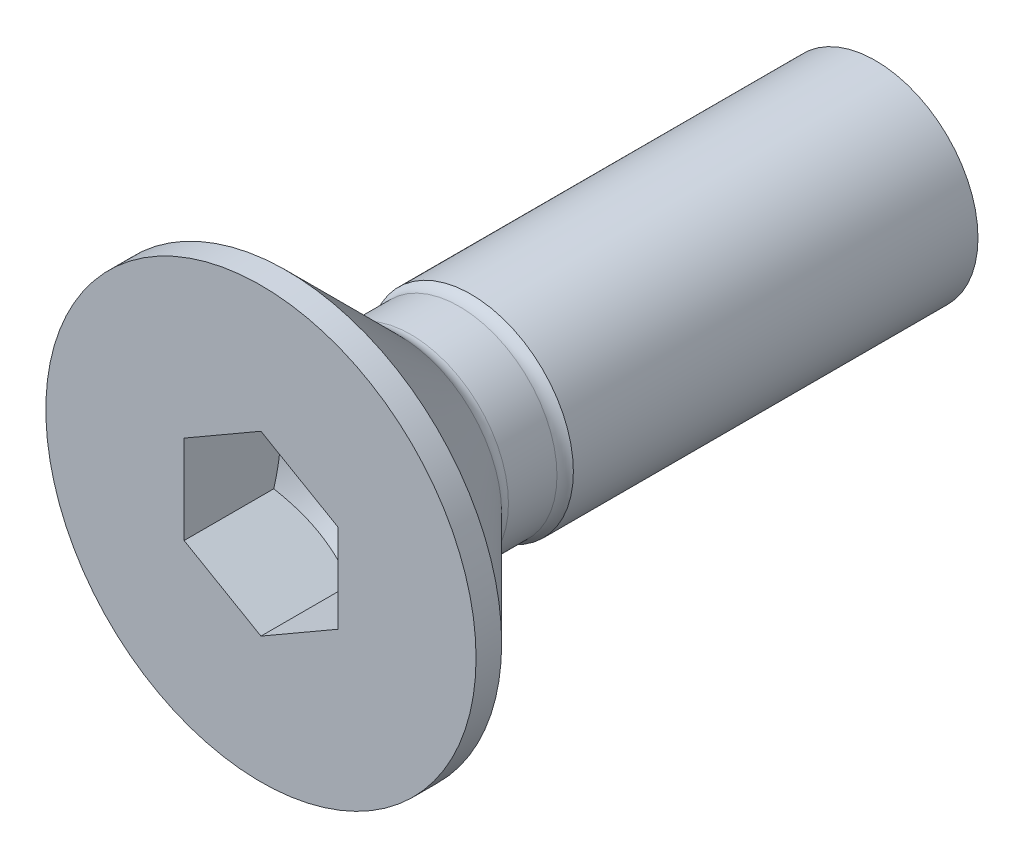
ISO-10303-21;
HEADER;
FILE_DESCRIPTION(('STEP AP214'),'2;1');
FILE_NAME('part.step','',(''),(''),'','','');
FILE_SCHEMA(('AUTOMOTIVE_DESIGN { 1 0 10303 214 1 1 1 1 }'));
ENDSEC;
DATA;
#1=APPLICATION_CONTEXT('core data for automotive mechanical design processes');
#2=APPLICATION_PROTOCOL_DEFINITION('international standard','automotive_design',2000,#1);
#3=PRODUCT_CONTEXT('',#1,'mechanical');
#4=PRODUCT('Part','Part','',(#3));
#5=PRODUCT_RELATED_PRODUCT_CATEGORY('part','',(#4));
#6=PRODUCT_DEFINITION_FORMATION('','',#4);
#7=PRODUCT_DEFINITION_CONTEXT('part definition',#1,'design');
#8=PRODUCT_DEFINITION('design','',#6,#7);
#9=PRODUCT_DEFINITION_SHAPE('','',#8);
#10=(LENGTH_UNIT() NAMED_UNIT(*) SI_UNIT(.MILLI.,.METRE.));
#11=(NAMED_UNIT(*) PLANE_ANGLE_UNIT() SI_UNIT($,.RADIAN.));
#12=(NAMED_UNIT(*) SI_UNIT($,.STERADIAN.) SOLID_ANGLE_UNIT());
#13=UNCERTAINTY_MEASURE_WITH_UNIT(LENGTH_MEASURE(1.E-05),#10,'distance_accuracy_value','');
#14=(GEOMETRIC_REPRESENTATION_CONTEXT(3) GLOBAL_UNCERTAINTY_ASSIGNED_CONTEXT((#13)) GLOBAL_UNIT_ASSIGNED_CONTEXT((#10,
#11,#12)) REPRESENTATION_CONTEXT('',''));
#15=CARTESIAN_POINT('',(0.,0.,0.));
#16=DIRECTION('',(0.,0.,1.));
#17=DIRECTION('',(1.,0.,0.));
#18=AXIS2_PLACEMENT_3D('',#15,#16,#17);
#19=CARTESIAN_POINT('',(0.,4.2,0.));
#20=DIRECTION('',(0.,0.,-1.));
#21=DIRECTION('',(-1.,0.,0.));
#22=AXIS2_PLACEMENT_3D('',#19,#20,#21);
#23=PLANE('',#22);
#24=CARTESIAN_POINT('',(0.,0.,0.));
#25=DIRECTION('',(0.,0.,1.));
#26=DIRECTION('',(1.,0.,0.));
#27=AXIS2_PLACEMENT_3D('',#24,#25,#26);
#28=CIRCLE('',#27,4.2);
#29=CARTESIAN_POINT('',(4.2,0.,0.));
#30=VERTEX_POINT('',#29);
#31=EDGE_CURVE('E106',#30,#30,#28,.T.);
#32=ORIENTED_EDGE('',*,*,#31,.T.);
#33=EDGE_LOOP('',(#32));
#34=FACE_BOUND('',#33,.T.);
#35=DIRECTION('',(-0.866025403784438,-0.5,0.));
#36=VECTOR('',#35,1.);
#37=CARTESIAN_POINT('',(1.49999930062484,-0.866025,0.));
#38=LINE('',#37,#36);
#39=CARTESIAN_POINT('',(1.49999930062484,-0.866025,0.));
#40=VERTEX_POINT('',#39);
#41=CARTESIAN_POINT('',(0.,-1.73205,0.));
#42=VERTEX_POINT('',#41);
#43=EDGE_CURVE('E30',#40,#42,#38,.T.);
#44=ORIENTED_EDGE('',*,*,#43,.T.);
#45=DIRECTION('',(-0.866025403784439,0.5,0.));
#46=VECTOR('',#45,1.);
#47=CARTESIAN_POINT('',(0.,-1.73205,0.));
#48=LINE('',#47,#46);
#49=CARTESIAN_POINT('',(-1.49999930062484,-0.866025,0.));
#50=VERTEX_POINT('',#49);
#51=EDGE_CURVE('E175',#42,#50,#48,.T.);
#52=ORIENTED_EDGE('',*,*,#51,.T.);
#53=DIRECTION('',(0.,1.,0.));
#54=VECTOR('',#53,1.);
#55=CARTESIAN_POINT('',(-1.49999930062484,-0.866025,0.));
#56=LINE('',#55,#54);
#57=CARTESIAN_POINT('',(-1.49999930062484,0.866025,0.));
#58=VERTEX_POINT('',#57);
#59=EDGE_CURVE('E230',#50,#58,#56,.T.);
#60=ORIENTED_EDGE('',*,*,#59,.T.);
#61=DIRECTION('',(0.866025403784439,0.5,0.));
#62=VECTOR('',#61,1.);
#63=CARTESIAN_POINT('',(-1.49999930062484,0.866025,0.));
#64=LINE('',#63,#62);
#65=CARTESIAN_POINT('',(0.,1.73205,0.));
#66=VERTEX_POINT('',#65);
#67=EDGE_CURVE('E228',#58,#66,#64,.T.);
#68=ORIENTED_EDGE('',*,*,#67,.T.);
#69=DIRECTION('',(0.866025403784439,-0.5,0.));
#70=VECTOR('',#69,1.);
#71=CARTESIAN_POINT('',(0.,1.73205,0.));
#72=LINE('',#71,#70);
#73=CARTESIAN_POINT('',(1.49999930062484,0.866025,0.));
#74=VERTEX_POINT('',#73);
#75=EDGE_CURVE('E95',#66,#74,#72,.T.);
#76=ORIENTED_EDGE('',*,*,#75,.T.);
#77=DIRECTION('',(0.,-1.,0.));
#78=VECTOR('',#77,1.);
#79=CARTESIAN_POINT('',(1.49999930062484,0.866025,0.));
#80=LINE('',#79,#78);
#81=EDGE_CURVE('E91',#74,#40,#80,.T.);
#82=ORIENTED_EDGE('',*,*,#81,.T.);
#83=EDGE_LOOP('',(#44,#52,#60,#68,#76,#82));
#84=FACE_BOUND('',#83,.T.);
#85=ADVANCED_FACE('F16',(#34,#84),#23,.F.);
#86=CARTESIAN_POINT('',(0.,0.,-12.));
#87=DIRECTION('',(0.,0.,1.));
#88=DIRECTION('',(1.,0.,0.));
#89=AXIS2_PLACEMENT_3D('',#86,#87,#88);
#90=PLANE('',#89);
#91=CARTESIAN_POINT('',(0.,0.,-12.));
#92=DIRECTION('',(0.,0.,1.));
#93=DIRECTION('',(1.,0.,0.));
#94=AXIS2_PLACEMENT_3D('',#91,#92,#93);
#95=CIRCLE('',#94,2.);
#96=CARTESIAN_POINT('',(2.,0.,-12.));
#97=VERTEX_POINT('',#96);
#98=EDGE_CURVE('E11',#97,#97,#95,.T.);
#99=ORIENTED_EDGE('',*,*,#98,.F.);
#100=EDGE_LOOP('',(#99));
#101=FACE_BOUND('',#100,.T.);
#102=ADVANCED_FACE('F129',(#101),#90,.F.);
#103=CARTESIAN_POINT('',(0.,0.,0.));
#104=DIRECTION('',(0.,0.,1.));
#105=DIRECTION('',(1.,0.,0.));
#106=AXIS2_PLACEMENT_3D('',#103,#104,#105);
#107=CYLINDRICAL_SURFACE('',#106,2.);
#108=CARTESIAN_POINT('',(0.,0.,-4.1));
#109=DIRECTION('',(0.,0.,1.));
#110=DIRECTION('',(1.,0.,0.));
#111=AXIS2_PLACEMENT_3D('',#108,#109,#110);
#112=CIRCLE('',#111,2.);
#113=CARTESIAN_POINT('',(2.,0.,-4.1));
#114=VERTEX_POINT('',#113);
#115=EDGE_CURVE('E23',#114,#114,#112,.T.);
#116=ORIENTED_EDGE('',*,*,#115,.F.);
#117=EDGE_LOOP('',(#116));
#118=FACE_BOUND('',#117,.T.);
#119=ORIENTED_EDGE('',*,*,#98,.T.);
#120=EDGE_LOOP('',(#119));
#121=FACE_BOUND('',#120,.T.);
#122=ADVANCED_FACE('F126',(#118,#121),#107,.T.);
#123=CARTESIAN_POINT('',(0.,0.,-3.8737258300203));
#124=DIRECTION('',(0.,0.,1.));
#125=DIRECTION('',(1.,0.,0.));
#126=AXIS2_PLACEMENT_3D('',#123,#124,#125);
#127=TOROIDAL_SURFACE('',#126,2.2262741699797,0.32);
#128=ORIENTED_EDGE('',*,*,#115,.T.);
#129=EDGE_LOOP('',(#128));
#130=FACE_BOUND('',#129,.T.);
#131=CARTESIAN_POINT('',(0.,0.,-3.8737258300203));
#132=DIRECTION('',(0.,0.,1.));
#133=DIRECTION('',(1.,0.,0.));
#134=AXIS2_PLACEMENT_3D('',#131,#132,#133);
#135=CIRCLE('',#134,1.9062741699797);
#136=CARTESIAN_POINT('',(1.9062741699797,0.,-3.8737258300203));
#137=VERTEX_POINT('',#136);
#138=EDGE_CURVE('E118',#137,#137,#135,.T.);
#139=ORIENTED_EDGE('',*,*,#138,.F.);
#140=EDGE_LOOP('',(#139));
#141=FACE_BOUND('',#140,.T.);
#142=ADVANCED_FACE('F123',(#130,#141),#127,.F.);
#143=CARTESIAN_POINT('',(0.,0.,0.));
#144=DIRECTION('',(0.,0.,1.));
#145=DIRECTION('',(1.,0.,0.));
#146=AXIS2_PLACEMENT_3D('',#143,#144,#145);
#147=CYLINDRICAL_SURFACE('',#146,1.9062741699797);
#148=CARTESIAN_POINT('',(0.,0.,-2.9262741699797));
#149=DIRECTION('',(0.,0.,1.));
#150=DIRECTION('',(1.,0.,0.));
#151=AXIS2_PLACEMENT_3D('',#148,#149,#150);
#152=CIRCLE('',#151,1.9062741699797);
#153=CARTESIAN_POINT('',(1.9062741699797,0.,-2.9262741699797));
#154=VERTEX_POINT('',#153);
#155=EDGE_CURVE('E115',#154,#154,#152,.T.);
#156=ORIENTED_EDGE('',*,*,#155,.F.);
#157=EDGE_LOOP('',(#156));
#158=FACE_BOUND('',#157,.T.);
#159=ORIENTED_EDGE('',*,*,#138,.T.);
#160=EDGE_LOOP('',(#159));
#161=FACE_BOUND('',#160,.T.);
#162=ADVANCED_FACE('F142',(#158,#161),#147,.T.);
#163=CARTESIAN_POINT('',(0.,0.,-2.9262741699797));
#164=DIRECTION('',(0.,0.,1.));
#165=DIRECTION('',(1.,0.,0.));
#166=AXIS2_PLACEMENT_3D('',#163,#164,#165);
#167=TOROIDAL_SURFACE('',#166,2.2262741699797,0.32);
#168=ORIENTED_EDGE('',*,*,#155,.T.);
#169=EDGE_LOOP('',(#168));
#170=FACE_BOUND('',#169,.T.);
#171=CARTESIAN_POINT('',(0.,0.,-2.7));
#172=DIRECTION('',(0.,0.,1.));
#173=DIRECTION('',(1.,0.,0.));
#174=AXIS2_PLACEMENT_3D('',#171,#172,#173);
#175=CIRCLE('',#174,2.);
#176=CARTESIAN_POINT('',(2.,0.,-2.7));
#177=VERTEX_POINT('',#176);
#178=EDGE_CURVE('E112',#177,#177,#175,.T.);
#179=ORIENTED_EDGE('',*,*,#178,.F.);
#180=EDGE_LOOP('',(#179));
#181=FACE_BOUND('',#180,.T.);
#182=ADVANCED_FACE('F145',(#170,#181),#167,.F.);
#183=CARTESIAN_POINT('',(0.,0.,-2.7));
#184=DIRECTION('',(0.,0.,1.));
#185=DIRECTION('',(1.,0.,0.));
#186=AXIS2_PLACEMENT_3D('',#183,#184,#185);
#187=CONICAL_SURFACE('',#186,2.,0.785398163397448);
#188=CARTESIAN_POINT('',(0.,0.,-0.5));
#189=DIRECTION('',(0.,0.,1.));
#190=DIRECTION('',(1.,0.,0.));
#191=AXIS2_PLACEMENT_3D('',#188,#189,#190);
#192=CIRCLE('',#191,4.2);
#193=CARTESIAN_POINT('',(4.2,0.,-0.5));
#194=VERTEX_POINT('',#193);
#195=EDGE_CURVE('E109',#194,#194,#192,.T.);
#196=ORIENTED_EDGE('',*,*,#195,.F.);
#197=EDGE_LOOP('',(#196));
#198=FACE_BOUND('',#197,.T.);
#199=ORIENTED_EDGE('',*,*,#178,.T.);
#200=EDGE_LOOP('',(#199));
#201=FACE_BOUND('',#200,.T.);
#202=ADVANCED_FACE('F149',(#198,#201),#187,.T.);
#203=CARTESIAN_POINT('',(0.,0.,0.));
#204=DIRECTION('',(0.,0.,1.));
#205=DIRECTION('',(1.,0.,0.));
#206=AXIS2_PLACEMENT_3D('',#203,#204,#205);
#207=CYLINDRICAL_SURFACE('',#206,4.2);
#208=ORIENTED_EDGE('',*,*,#31,.F.);
#209=EDGE_LOOP('',(#208));
#210=FACE_BOUND('',#209,.T.);
#211=ORIENTED_EDGE('',*,*,#195,.T.);
#212=EDGE_LOOP('',(#211));
#213=FACE_BOUND('',#212,.T.);
#214=ADVANCED_FACE('F153',(#210,#213),#207,.T.);
#215=CARTESIAN_POINT('',(1.49999930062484,-0.866025,-2.74999953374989));
#216=DIRECTION('',(-0.5,0.866025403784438,0.));
#217=DIRECTION('',(0.866025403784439,0.5,0.));
#218=AXIS2_PLACEMENT_3D('',#215,#216,#217);
#219=PLANE('',#218);
#220=DIRECTION('',(0.,0.,1.));
#221=VECTOR('',#220,1.);
#222=CARTESIAN_POINT('',(0.,-1.73205,-2.74999953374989));
#223=LINE('',#222,#221);
#224=CARTESIAN_POINT('',(0.,-1.73205,-1.75));
#225=VERTEX_POINT('',#224);
#226=EDGE_CURVE('E104',#225,#42,#223,.T.);
#227=ORIENTED_EDGE('',*,*,#226,.T.);
#228=ORIENTED_EDGE('',*,*,#43,.F.);
#229=DIRECTION('',(0.,0.,1.));
#230=VECTOR('',#229,1.);
#231=CARTESIAN_POINT('',(1.49999930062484,-0.866025,-2.74999953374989));
#232=LINE('',#231,#230);
#233=CARTESIAN_POINT('',(1.49999930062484,-0.866025,-1.75));
#234=VERTEX_POINT('',#233);
#235=EDGE_CURVE('E85',#234,#40,#232,.T.);
#236=ORIENTED_EDGE('',*,*,#235,.F.);
#237=CARTESIAN_POINT('',(-1.99999999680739E-07,-1.73205011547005,-1.74999993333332));
#238=CARTESIAN_POINT('',(0.0659156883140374,-1.69399355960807,-1.77197826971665));
#239=CARTESIAN_POINT('',(0.132400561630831,-1.65560850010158,-1.79196641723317));
#240=CARTESIAN_POINT('',(0.266521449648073,-1.57817376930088,-1.82685513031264));
#241=CARTESIAN_POINT('',(0.334159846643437,-1.53912272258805,-1.84174335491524));
#242=CARTESIAN_POINT('',(0.468598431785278,-1.46150456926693,-1.86491795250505));
#243=CARTESIAN_POINT('',(0.535377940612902,-1.42294940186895,-1.87335858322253));
#244=CARTESIAN_POINT('',(0.669251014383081,-1.3456577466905,-1.88343305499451));
#245=CARTESIAN_POINT('',(0.736344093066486,-1.30692153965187,-1.88507524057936));
#246=CARTESIAN_POINT('',(0.861700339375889,-1.23454707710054,-1.88165022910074));
#247=CARTESIAN_POINT('',(0.919982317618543,-1.20089796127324,-1.87742398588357));
#248=CARTESIAN_POINT('',(1.03616658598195,-1.13381894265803,-1.86403197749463));
#249=CARTESIAN_POINT('',(1.09406847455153,-1.10038927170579,-1.8548616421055));
#250=CARTESIAN_POINT('',(1.21049209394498,-1.03317206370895,-1.83193757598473));
#251=CARTESIAN_POINT('',(1.26899909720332,-0.99939302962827,-1.81808671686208));
#252=CARTESIAN_POINT('',(1.38514072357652,-0.932338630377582,-1.78665112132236));
#253=CARTESIAN_POINT('',(1.44277683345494,-0.899062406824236,-1.76907376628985));
#254=CARTESIAN_POINT('',(1.49999950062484,-0.866024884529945,-1.74999993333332));
#255=B_SPLINE_CURVE_WITH_KNOTS('',3,(#237,#238,#239,#240,#241,#242,#243,#244,#245,#246,#247,
#248,#249,#250,#251,#252,#253,#254),.UNSPECIFIED.,.F.,.F.,(4,2,2,2,2,2,2,2,4),(0.,
0.237761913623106,0.476095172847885,0.708530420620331,0.940680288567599,1.14278046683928,
1.34506778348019,1.5518408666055,1.75820814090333),.UNSPECIFIED.);
#256=EDGE_CURVE('E78',#225,#234,#255,.T.);
#257=ORIENTED_EDGE('',*,*,#256,.F.);
#258=EDGE_LOOP('',(#227,#228,#236,#257));
#259=FACE_BOUND('',#258,.T.);
#260=ADVANCED_FACE('F86',(#259),#219,.T.);
#261=CARTESIAN_POINT('',(0.,-1.73205,-2.74999953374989));
#262=DIRECTION('',(0.5,0.866025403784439,0.));
#263=DIRECTION('',(0.866025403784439,-0.5,0.));
#264=AXIS2_PLACEMENT_3D('',#261,#262,#263);
#265=PLANE('',#264);
#266=DIRECTION('',(0.,0.,1.));
#267=VECTOR('',#266,1.);
#268=CARTESIAN_POINT('',(-1.49999930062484,-0.866025,-2.74999953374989));
#269=LINE('',#268,#267);
#270=CARTESIAN_POINT('',(-1.49999930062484,-0.866025,-1.75));
#271=VERTEX_POINT('',#270);
#272=EDGE_CURVE('E102',#271,#50,#269,.T.);
#273=ORIENTED_EDGE('',*,*,#272,.T.);
#274=ORIENTED_EDGE('',*,*,#51,.F.);
#275=ORIENTED_EDGE('',*,*,#226,.F.);
#276=CARTESIAN_POINT('',(-1.49999950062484,-0.866024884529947,-1.74999993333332));
#277=CARTESIAN_POINT('',(-1.4340836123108,-0.904081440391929,-1.77197826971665));
#278=CARTESIAN_POINT('',(-1.36759873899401,-0.942466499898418,-1.79196641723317));
#279=CARTESIAN_POINT('',(-1.23347785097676,-1.01990123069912,-1.82685513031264));
#280=CARTESIAN_POINT('',(-1.1658394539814,-1.05895227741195,-1.84174335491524));
#281=CARTESIAN_POINT('',(-1.03140086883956,-1.13657043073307,-1.86491795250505));
#282=CARTESIAN_POINT('',(-0.964621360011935,-1.17512559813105,-1.87335858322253));
#283=CARTESIAN_POINT('',(-0.830748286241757,-1.2524172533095,-1.88343305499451));
#284=CARTESIAN_POINT('',(-0.763655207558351,-1.29115346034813,-1.88507524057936));
#285=CARTESIAN_POINT('',(-0.638298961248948,-1.36352792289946,-1.88165022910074));
#286=CARTESIAN_POINT('',(-0.580016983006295,-1.39717703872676,-1.87742398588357));
#287=CARTESIAN_POINT('',(-0.46383271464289,-1.46425605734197,-1.86403197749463));
#288=CARTESIAN_POINT('',(-0.405930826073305,-1.49768572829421,-1.8548616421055));
#289=CARTESIAN_POINT('',(-0.289507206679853,-1.56490293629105,-1.83193757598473));
#290=CARTESIAN_POINT('',(-0.231000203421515,-1.59868197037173,-1.81808671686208));
#291=CARTESIAN_POINT('',(-0.114858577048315,-1.66573636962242,-1.78665112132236));
#292=CARTESIAN_POINT('',(-0.0572224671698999,-1.69901259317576,-1.76907376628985));
#293=CARTESIAN_POINT('',(2.00000000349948E-07,-1.73205011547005,-1.74999993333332));
#294=B_SPLINE_CURVE_WITH_KNOTS('',3,(#276,#277,#278,#279,#280,#281,#282,#283,#284,#285,#286,
#287,#288,#289,#290,#291,#292,#293),.UNSPECIFIED.,.F.,.F.,(4,2,2,2,2,2,2,2,4),(0.,
0.237761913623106,0.476095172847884,0.70853042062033,0.940680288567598,1.14278046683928,
1.34506778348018,1.5518408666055,1.75820814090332),.UNSPECIFIED.);
#295=EDGE_CURVE('E82',#271,#225,#294,.T.);
#296=ORIENTED_EDGE('',*,*,#295,.F.);
#297=EDGE_LOOP('',(#273,#274,#275,#296));
#298=FACE_BOUND('',#297,.T.);
#299=ADVANCED_FACE('F161',(#298),#265,.T.);
#300=CARTESIAN_POINT('',(-1.49999930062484,-0.866025,-2.74999953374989));
#301=DIRECTION('',(1.,0.,0.));
#302=DIRECTION('',(0.,-1.,0.));
#303=AXIS2_PLACEMENT_3D('',#300,#301,#302);
#304=PLANE('',#303);
#305=DIRECTION('',(0.,0.,1.));
#306=VECTOR('',#305,1.);
#307=CARTESIAN_POINT('',(-1.49999930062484,0.866025,-2.74999953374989));
#308=LINE('',#307,#306);
#309=CARTESIAN_POINT('',(-1.49999930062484,0.866025,-1.75));
#310=VERTEX_POINT('',#309);
#311=EDGE_CURVE('E100',#310,#58,#308,.T.);
#312=ORIENTED_EDGE('',*,*,#311,.T.);
#313=ORIENTED_EDGE('',*,*,#59,.F.);
#314=ORIENTED_EDGE('',*,*,#272,.F.);
#315=CARTESIAN_POINT('',(-1.49999930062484,-2.24271663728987,-1.19224732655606));
#316=CARTESIAN_POINT('',(-1.49999930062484,-2.17794141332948,-1.2233240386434));
#317=CARTESIAN_POINT('',(-1.49999930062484,-2.11300852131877,-1.25407788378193));
#318=CARTESIAN_POINT('',(-1.49999930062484,-1.98274303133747,-1.31475688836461));
#319=CARTESIAN_POINT('',(-1.49999930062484,-1.91741036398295,-1.34468189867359));
#320=CARTESIAN_POINT('',(-1.49999930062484,-1.78588635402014,-1.40368745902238));
#321=CARTESIAN_POINT('',(-1.49999930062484,-1.71969220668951,-1.43276178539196));
#322=CARTESIAN_POINT('',(-1.49999930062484,-1.58674953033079,-1.48960603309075));
#323=CARTESIAN_POINT('',(-1.49999930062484,-1.52000103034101,-1.51737602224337));
#324=CARTESIAN_POINT('',(-1.49999930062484,-1.3840803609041,-1.57197454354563));
#325=CARTESIAN_POINT('',(-1.49999930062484,-1.31489044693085,-1.59875948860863));
#326=CARTESIAN_POINT('',(-1.49999930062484,-1.17568875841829,-1.65009347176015));
#327=CARTESIAN_POINT('',(-1.49999930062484,-1.10567688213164,-1.67464222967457));
#328=CARTESIAN_POINT('',(-1.49999930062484,-0.894522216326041,-1.74389891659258));
#329=CARTESIAN_POINT('',(-1.49999930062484,-0.751873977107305,-1.78437972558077));
#330=CARTESIAN_POINT('',(-1.49999930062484,-0.535047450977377,-1.83133547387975));
#331=CARTESIAN_POINT('',(-1.49999930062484,-0.462365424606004,-1.8446870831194));
#332=CARTESIAN_POINT('',(-1.49999930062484,-0.316183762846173,-1.86588652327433));
#333=CARTESIAN_POINT('',(-1.49999930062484,-0.242684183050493,-1.8737347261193));
#334=CARTESIAN_POINT('',(-1.49999930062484,-0.0961588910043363,-1.88320140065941));
#335=CARTESIAN_POINT('',(-1.49999930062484,-0.0231380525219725,-1.88489338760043));
#336=CARTESIAN_POINT('',(-1.49999930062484,0.122783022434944,-1.8821005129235));
#337=CARTESIAN_POINT('',(-1.49999930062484,0.195683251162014,-1.87761526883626));
#338=CARTESIAN_POINT('',(-1.49999930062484,0.375553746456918,-1.85932231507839));
#339=CARTESIAN_POINT('',(-1.49999930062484,0.482175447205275,-1.84208645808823));
#340=CARTESIAN_POINT('',(-1.49999930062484,0.693345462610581,-1.79764015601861));
#341=CARTESIAN_POINT('',(-1.49999930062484,0.797891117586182,-1.77041768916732));
#342=CARTESIAN_POINT('',(-1.49999930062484,0.954250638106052,-1.72391506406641));
#343=CARTESIAN_POINT('',(-1.49999930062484,1.00687274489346,-1.70725248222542));
#344=CARTESIAN_POINT('',(-1.49999930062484,1.11156919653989,-1.67238593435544));
#345=CARTESIAN_POINT('',(-1.49999930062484,1.16364386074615,-1.65418293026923));
#346=CARTESIAN_POINT('',(-1.49999930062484,1.26731501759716,-1.61649989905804));
#347=CARTESIAN_POINT('',(-1.49999930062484,1.31891159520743,-1.59702010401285));
#348=CARTESIAN_POINT('',(-1.49999930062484,1.4216981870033,-1.55699419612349));
#349=CARTESIAN_POINT('',(-1.49999930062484,1.472888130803,-1.53644790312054));
#350=CARTESIAN_POINT('',(-1.49999930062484,1.60355204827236,-1.48268670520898));
#351=CARTESIAN_POINT('',(-1.49999930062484,1.68276475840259,-1.44883749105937));
#352=CARTESIAN_POINT('',(-1.49999930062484,1.84047486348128,-1.37950734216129));
#353=CARTESIAN_POINT('',(-1.49999930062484,1.91897220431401,-1.34402628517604));
#354=CARTESIAN_POINT('',(-1.49999930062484,2.15362953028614,-1.23571059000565));
#355=CARTESIAN_POINT('',(-1.49999930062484,2.30892860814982,-1.16101453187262));
#356=CARTESIAN_POINT('',(-1.49999930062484,2.61819999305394,-1.00848967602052));
#357=CARTESIAN_POINT('',(-1.49999930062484,2.77217043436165,-0.930657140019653));
#358=CARTESIAN_POINT('',(-1.49999930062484,3.07905639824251,-0.772990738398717));
#359=CARTESIAN_POINT('',(-1.49999930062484,3.23197205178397,-0.693157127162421));
#360=CARTESIAN_POINT('',(-1.49999930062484,3.52267463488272,-0.539711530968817));
#361=CARTESIAN_POINT('',(-1.49999930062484,3.66052723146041,-0.466223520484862));
#362=CARTESIAN_POINT('',(-1.49999930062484,3.93578899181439,-0.318410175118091));
#363=CARTESIAN_POINT('',(-1.49999930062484,4.07319813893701,-0.244084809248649));
#364=CARTESIAN_POINT('',(-1.49999930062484,4.34732572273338,-0.0949965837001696));
#365=CARTESIAN_POINT('',(-1.49999930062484,4.48404502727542,-0.0202353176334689));
#366=CARTESIAN_POINT('',(-1.49999930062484,4.75720722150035,0.129773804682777));
#367=CARTESIAN_POINT('',(-1.49999930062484,4.89365012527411,0.205021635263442));
#368=CARTESIAN_POINT('',(-1.49999930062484,5.02999372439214,0.280447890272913));
#369=B_SPLINE_CURVE_WITH_KNOTS('',3,(#315,#316,#317,#318,#319,#320,#321,#322,#323,#324,#325,
#326,#327,#328,#329,#330,#331,#332,#333,#334,#335,#336,#337,#338,#339,#340,#341,#342,#343,#344,
#345,#346,#347,#348,#349,#350,#351,#352,#353,#354,#355,#356,#357,#358,#359,#360,#361,#362,#363,
#364,#365,#366,#367,#368),.UNSPECIFIED.,.F.,.F.,(4,2,2,2,2,2,2,2,2,2,2,2,2,2,2,2,2,2,2,2,2,2,2,
2,2,2,4),(0.,0.215535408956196,0.431109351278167,0.647990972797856,0.864861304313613,
1.08740082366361,1.30996818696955,1.75384735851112,1.97537373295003,2.19688513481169,
2.41574248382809,2.63461338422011,2.95796620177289,3.28170955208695,3.4472828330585,
3.61275347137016,3.77819411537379,3.94366279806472,4.20206177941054,4.46048014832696,
4.97740223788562,5.49495979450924,6.012451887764,6.48110033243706,6.94976617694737,
7.41723996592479,7.88468929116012),.UNSPECIFIED.);
#370=EDGE_CURVE('E203',#310,#271,#369,.F.);
#371=ORIENTED_EDGE('',*,*,#370,.F.);
#372=EDGE_LOOP('',(#312,#313,#314,#371));
#373=FACE_BOUND('',#372,.T.);
#374=ADVANCED_FACE('F208',(#373),#304,.T.);
#375=CARTESIAN_POINT('',(-1.49999930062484,0.866025,-2.74999953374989));
#376=DIRECTION('',(0.5,-0.866025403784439,0.));
#377=DIRECTION('',(-0.866025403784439,-0.5,0.));
#378=AXIS2_PLACEMENT_3D('',#375,#376,#377);
#379=PLANE('',#378);
#380=DIRECTION('',(0.,0.,1.));
#381=VECTOR('',#380,1.);
#382=CARTESIAN_POINT('',(0.,1.73205,-2.74999953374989));
#383=LINE('',#382,#381);
#384=CARTESIAN_POINT('',(0.,1.73205,-1.75));
#385=VERTEX_POINT('',#384);
#386=EDGE_CURVE('E93',#385,#66,#383,.T.);
#387=ORIENTED_EDGE('',*,*,#386,.T.);
#388=ORIENTED_EDGE('',*,*,#67,.F.);
#389=ORIENTED_EDGE('',*,*,#311,.F.);
#390=CARTESIAN_POINT('',(1.99999999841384E-07,1.73205011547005,-1.74999993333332));
#391=CARTESIAN_POINT('',(-0.0659156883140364,1.69399355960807,-1.77197826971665));
#392=CARTESIAN_POINT('',(-0.13240056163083,1.65560850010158,-1.79196641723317));
#393=CARTESIAN_POINT('',(-0.266521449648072,1.57817376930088,-1.82685513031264));
#394=CARTESIAN_POINT('',(-0.334159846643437,1.53912272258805,-1.84174335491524));
#395=CARTESIAN_POINT('',(-0.468598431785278,1.46150456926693,-1.86491795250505));
#396=CARTESIAN_POINT('',(-0.535377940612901,1.42294940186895,-1.87335858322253));
#397=CARTESIAN_POINT('',(-0.66925101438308,1.3456577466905,-1.88343305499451));
#398=CARTESIAN_POINT('',(-0.736344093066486,1.30692153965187,-1.88507524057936));
#399=CARTESIAN_POINT('',(-0.861700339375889,1.23454707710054,-1.88165022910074));
#400=CARTESIAN_POINT('',(-0.919982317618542,1.20089796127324,-1.87742398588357));
#401=CARTESIAN_POINT('',(-1.03616658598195,1.13381894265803,-1.86403197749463));
#402=CARTESIAN_POINT('',(-1.09406847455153,1.10038927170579,-1.8548616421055));
#403=CARTESIAN_POINT('',(-1.21049209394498,1.03317206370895,-1.83193757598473));
#404=CARTESIAN_POINT('',(-1.26899909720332,0.99939302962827,-1.81808671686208));
#405=CARTESIAN_POINT('',(-1.38514072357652,0.932338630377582,-1.78665112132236));
#406=CARTESIAN_POINT('',(-1.44277683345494,0.899062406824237,-1.76907376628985));
#407=CARTESIAN_POINT('',(-1.49999950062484,0.866024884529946,-1.74999993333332));
#408=B_SPLINE_CURVE_WITH_KNOTS('',3,(#390,#391,#392,#393,#394,#395,#396,#397,#398,#399,#400,
#401,#402,#403,#404,#405,#406,#407),.UNSPECIFIED.,.F.,.F.,(4,2,2,2,2,2,2,2,4),(0.,
0.237761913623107,0.476095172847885,0.708530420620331,0.940680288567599,1.14278046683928,
1.34506778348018,1.5518408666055,1.75820814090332),.UNSPECIFIED.);
#409=EDGE_CURVE('E197',#385,#310,#408,.T.);
#410=ORIENTED_EDGE('',*,*,#409,.F.);
#411=EDGE_LOOP('',(#387,#388,#389,#410));
#412=FACE_BOUND('',#411,.T.);
#413=ADVANCED_FACE('F211',(#412),#379,.T.);
#414=CARTESIAN_POINT('',(0.,1.73205,-2.74999953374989));
#415=DIRECTION('',(-0.5,-0.866025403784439,0.));
#416=DIRECTION('',(-0.866025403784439,0.5,0.));
#417=AXIS2_PLACEMENT_3D('',#414,#415,#416);
#418=PLANE('',#417);
#419=DIRECTION('',(0.,0.,1.));
#420=VECTOR('',#419,1.);
#421=CARTESIAN_POINT('',(1.49999930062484,0.866025,-2.74999953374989));
#422=LINE('',#421,#420);
#423=CARTESIAN_POINT('',(1.49999930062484,0.866025,-1.75));
#424=VERTEX_POINT('',#423);
#425=EDGE_CURVE('E90',#424,#74,#422,.T.);
#426=ORIENTED_EDGE('',*,*,#425,.T.);
#427=ORIENTED_EDGE('',*,*,#75,.F.);
#428=ORIENTED_EDGE('',*,*,#386,.F.);
#429=CARTESIAN_POINT('',(1.49999950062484,0.866024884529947,-1.74999993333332));
#430=CARTESIAN_POINT('',(1.4340836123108,0.90408144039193,-1.77197826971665));
#431=CARTESIAN_POINT('',(1.36759873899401,0.942466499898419,-1.79196641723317));
#432=CARTESIAN_POINT('',(1.23347785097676,1.01990123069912,-1.82685513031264));
#433=CARTESIAN_POINT('',(1.1658394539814,1.05895227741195,-1.84174335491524));
#434=CARTESIAN_POINT('',(1.03140086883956,1.13657043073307,-1.86491795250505));
#435=CARTESIAN_POINT('',(0.964621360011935,1.17512559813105,-1.87335858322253));
#436=CARTESIAN_POINT('',(0.830748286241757,1.2524172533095,-1.88343305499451));
#437=CARTESIAN_POINT('',(0.763655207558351,1.29115346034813,-1.88507524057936));
#438=CARTESIAN_POINT('',(0.638298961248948,1.36352792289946,-1.88165022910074));
#439=CARTESIAN_POINT('',(0.580016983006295,1.39717703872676,-1.87742398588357));
#440=CARTESIAN_POINT('',(0.46383271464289,1.46425605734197,-1.86403197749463));
#441=CARTESIAN_POINT('',(0.405930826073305,1.49768572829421,-1.8548616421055));
#442=CARTESIAN_POINT('',(0.289507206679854,1.56490293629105,-1.83193757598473));
#443=CARTESIAN_POINT('',(0.231000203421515,1.59868197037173,-1.81808671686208));
#444=CARTESIAN_POINT('',(0.114858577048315,1.66573636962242,-1.78665112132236));
#445=CARTESIAN_POINT('',(0.0572224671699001,1.69901259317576,-1.76907376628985));
#446=CARTESIAN_POINT('',(-2.00000000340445E-07,1.73205011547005,-1.74999993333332));
#447=B_SPLINE_CURVE_WITH_KNOTS('',3,(#429,#430,#431,#432,#433,#434,#435,#436,#437,#438,#439,
#440,#441,#442,#443,#444,#445,#446),.UNSPECIFIED.,.F.,.F.,(4,2,2,2,2,2,2,2,4),(0.,
0.237761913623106,0.476095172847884,0.70853042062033,0.940680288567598,1.14278046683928,
1.34506778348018,1.5518408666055,1.75820814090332),.UNSPECIFIED.);
#448=EDGE_CURVE('E38',#424,#385,#447,.T.);
#449=ORIENTED_EDGE('',*,*,#448,.F.);
#450=EDGE_LOOP('',(#426,#427,#428,#449));
#451=FACE_BOUND('',#450,.T.);
#452=ADVANCED_FACE('F215',(#451),#418,.T.);
#453=CARTESIAN_POINT('',(1.49999930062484,0.866025,-2.74999953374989));
#454=DIRECTION('',(-1.,0.,0.));
#455=DIRECTION('',(0.,1.,0.));
#456=AXIS2_PLACEMENT_3D('',#453,#454,#455);
#457=PLANE('',#456);
#458=ORIENTED_EDGE('',*,*,#235,.T.);
#459=ORIENTED_EDGE('',*,*,#81,.F.);
#460=ORIENTED_EDGE('',*,*,#425,.F.);
#461=CARTESIAN_POINT('',(1.49999930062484,-2.24271663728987,-1.19224732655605));
#462=CARTESIAN_POINT('',(1.49999930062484,-2.17794141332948,-1.2233240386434));
#463=CARTESIAN_POINT('',(1.49999930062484,-2.11300852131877,-1.25407788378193));
#464=CARTESIAN_POINT('',(1.49999930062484,-1.98274303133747,-1.31475688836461));
#465=CARTESIAN_POINT('',(1.49999930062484,-1.91741036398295,-1.34468189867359));
#466=CARTESIAN_POINT('',(1.49999930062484,-1.78588635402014,-1.40368745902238));
#467=CARTESIAN_POINT('',(1.49999930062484,-1.71969220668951,-1.43276178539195));
#468=CARTESIAN_POINT('',(1.49999930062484,-1.58674953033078,-1.48960603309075));
#469=CARTESIAN_POINT('',(1.49999930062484,-1.520001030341,-1.51737602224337));
#470=CARTESIAN_POINT('',(1.49999930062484,-1.3840803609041,-1.57197454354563));
#471=CARTESIAN_POINT('',(1.49999930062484,-1.31489044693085,-1.59875948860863));
#472=CARTESIAN_POINT('',(1.49999930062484,-1.17568875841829,-1.65009347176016));
#473=CARTESIAN_POINT('',(1.49999930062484,-1.10567688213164,-1.67464222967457));
#474=CARTESIAN_POINT('',(1.49999930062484,-0.894522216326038,-1.74389891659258));
#475=CARTESIAN_POINT('',(1.49999930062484,-0.751873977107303,-1.78437972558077));
#476=CARTESIAN_POINT('',(1.49999930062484,-0.535047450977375,-1.83133547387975));
#477=CARTESIAN_POINT('',(1.49999930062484,-0.462365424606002,-1.8446870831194));
#478=CARTESIAN_POINT('',(1.49999930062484,-0.316183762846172,-1.86588652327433));
#479=CARTESIAN_POINT('',(1.49999930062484,-0.242684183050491,-1.8737347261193));
#480=CARTESIAN_POINT('',(1.49999930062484,-0.0961588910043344,-1.88320140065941));
#481=CARTESIAN_POINT('',(1.49999930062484,-0.0231380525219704,-1.88489338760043));
#482=CARTESIAN_POINT('',(1.49999930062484,0.122783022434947,-1.8821005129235));
#483=CARTESIAN_POINT('',(1.49999930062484,0.195683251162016,-1.87761526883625));
#484=CARTESIAN_POINT('',(1.49999930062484,0.375553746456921,-1.85932231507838));
#485=CARTESIAN_POINT('',(1.49999930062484,0.482175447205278,-1.84208645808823));
#486=CARTESIAN_POINT('',(1.49999930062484,0.693345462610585,-1.79764015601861));
#487=CARTESIAN_POINT('',(1.49999930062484,0.797891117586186,-1.77041768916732));
#488=CARTESIAN_POINT('',(1.49999930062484,0.954250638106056,-1.72391506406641));
#489=CARTESIAN_POINT('',(1.49999930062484,1.00687274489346,-1.70725248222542));
#490=CARTESIAN_POINT('',(1.49999930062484,1.1115691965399,-1.67238593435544));
#491=CARTESIAN_POINT('',(1.49999930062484,1.16364386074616,-1.65418293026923));
#492=CARTESIAN_POINT('',(1.49999930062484,1.26731501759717,-1.61649989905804));
#493=CARTESIAN_POINT('',(1.49999930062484,1.31891159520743,-1.59702010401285));
#494=CARTESIAN_POINT('',(1.49999930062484,1.4216981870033,-1.55699419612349));
#495=CARTESIAN_POINT('',(1.49999930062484,1.47288813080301,-1.53644790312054));
#496=CARTESIAN_POINT('',(1.49999930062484,1.60355204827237,-1.48268670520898));
#497=CARTESIAN_POINT('',(1.49999930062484,1.68276475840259,-1.44883749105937));
#498=CARTESIAN_POINT('',(1.49999930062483,1.84047486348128,-1.37950734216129));
#499=CARTESIAN_POINT('',(1.49999930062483,1.91897220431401,-1.34402628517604));
#500=CARTESIAN_POINT('',(1.49999930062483,2.15362953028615,-1.23571059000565));
#501=CARTESIAN_POINT('',(1.49999930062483,2.30892860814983,-1.16101453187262));
#502=CARTESIAN_POINT('',(1.49999930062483,2.61819999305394,-1.00848967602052));
#503=CARTESIAN_POINT('',(1.49999930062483,2.77217043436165,-0.930657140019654));
#504=CARTESIAN_POINT('',(1.49999930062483,3.07905639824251,-0.772990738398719));
#505=CARTESIAN_POINT('',(1.49999930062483,3.23197205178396,-0.693157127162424));
#506=CARTESIAN_POINT('',(1.49999930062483,3.52267463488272,-0.53971153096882));
#507=CARTESIAN_POINT('',(1.49999930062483,3.66052723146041,-0.466223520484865));
#508=CARTESIAN_POINT('',(1.49999930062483,3.93578899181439,-0.318410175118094));
#509=CARTESIAN_POINT('',(1.49999930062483,4.07319813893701,-0.244084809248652));
#510=CARTESIAN_POINT('',(1.49999930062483,4.34732572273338,-0.0949965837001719));
#511=CARTESIAN_POINT('',(1.49999930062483,4.48404502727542,-0.0202353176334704));
#512=CARTESIAN_POINT('',(1.49999930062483,4.75720722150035,0.129773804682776));
#513=CARTESIAN_POINT('',(1.49999930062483,4.89365012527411,0.205021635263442));
#514=CARTESIAN_POINT('',(1.49999930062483,5.02999372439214,0.280447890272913));
#515=B_SPLINE_CURVE_WITH_KNOTS('',3,(#461,#462,#463,#464,#465,#466,#467,#468,#469,#470,#471,
#472,#473,#474,#475,#476,#477,#478,#479,#480,#481,#482,#483,#484,#485,#486,#487,#488,#489,#490,
#491,#492,#493,#494,#495,#496,#497,#498,#499,#500,#501,#502,#503,#504,#505,#506,#507,#508,#509,
#510,#511,#512,#513,#514),.UNSPECIFIED.,.F.,.F.,(4,2,2,2,2,2,2,2,2,2,2,2,2,2,2,2,2,2,2,2,2,2,2,
2,2,2,4),(0.,0.215535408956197,0.431109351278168,0.647990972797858,0.864861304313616,
1.08740082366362,1.30996818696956,1.75384735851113,1.97537373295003,2.19688513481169,
2.4157424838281,2.63461338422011,2.9579662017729,3.28170955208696,3.44728283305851,
3.61275347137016,3.77819411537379,3.94366279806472,4.20206177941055,4.46048014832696,
4.97740223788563,5.49495979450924,6.01245188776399,6.48110033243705,6.94976617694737,
7.41723996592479,7.88468929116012),.UNSPECIFIED.);
#516=EDGE_CURVE('E79',#234,#424,#515,.T.);
#517=ORIENTED_EDGE('',*,*,#516,.F.);
#518=EDGE_LOOP('',(#458,#459,#460,#517));
#519=FACE_BOUND('',#518,.T.);
#520=ADVANCED_FACE('F74',(#519),#457,.T.);
#521=CARTESIAN_POINT('',(0.,0.,-2.74999953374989));
#522=DIRECTION('',(0.,0.,1.));
#523=DIRECTION('',(1.,0.,0.));
#524=AXIS2_PLACEMENT_3D('',#521,#522,#523);
#525=CONICAL_SURFACE('',#524,0.,1.0471975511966);
#526=CARTESIAN_POINT('',(0.,0.,-2.74999953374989));
#527=VERTEX_POINT('',#526);
#528=VERTEX_LOOP('',#527);
#529=FACE_BOUND('',#528,.T.);
#530=ORIENTED_EDGE('',*,*,#256,.T.);
#531=ORIENTED_EDGE('',*,*,#516,.T.);
#532=ORIENTED_EDGE('',*,*,#448,.T.);
#533=ORIENTED_EDGE('',*,*,#409,.T.);
#534=ORIENTED_EDGE('',*,*,#370,.T.);
#535=ORIENTED_EDGE('',*,*,#295,.T.);
#536=EDGE_LOOP('',(#530,#531,#532,#533,#534,#535));
#537=FACE_BOUND('',#536,.T.);
#538=ADVANCED_FACE('F71',(#529,#537),#525,.F.);
#539=CLOSED_SHELL('',(#85,#102,#122,#142,#162,#182,#202,#214,#260,#299,#374,#413,#452,#520,#538));
#540=MANIFOLD_SOLID_BREP('B1',#539);
#541=ADVANCED_BREP_SHAPE_REPRESENTATION('',(#18,#540),#14);
#542=SHAPE_DEFINITION_REPRESENTATION(#9,#541);
ENDSEC;
END-ISO-10303-21;
